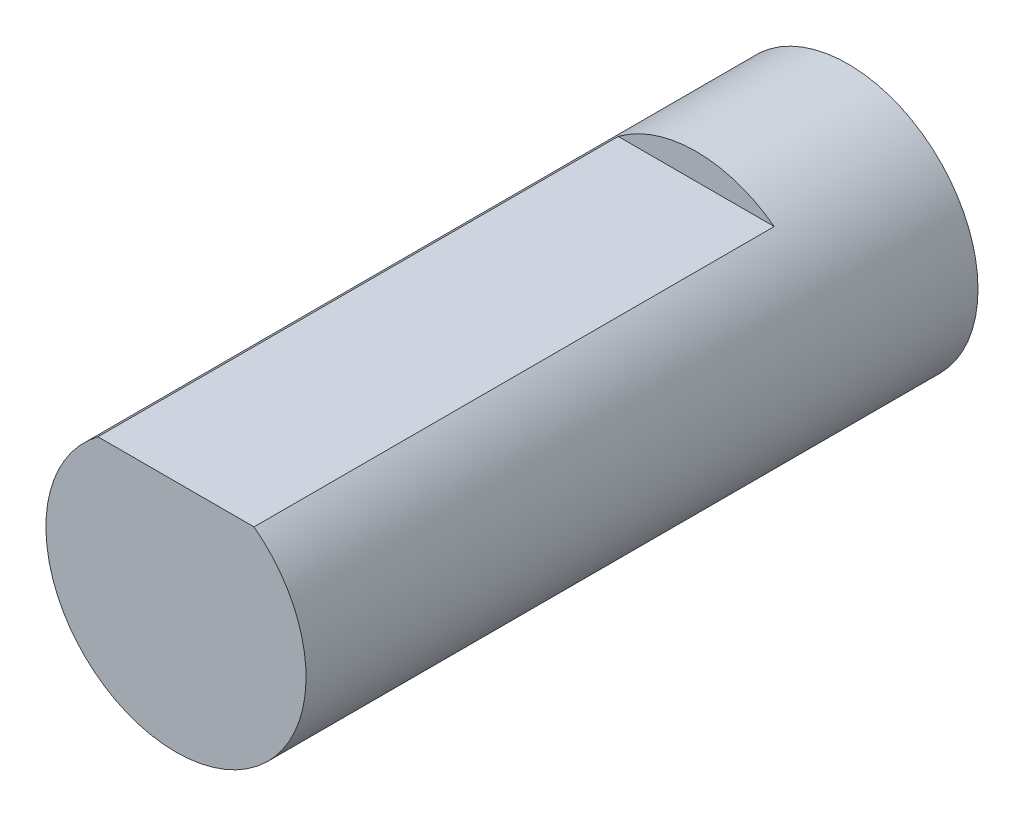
from build123d import *

# Parameters (mm, degrees)
ESQUISSE1_R             = 3
BOSS_EXTRU_1_DEPTH      = 15.5
ENL_V_START             = -12
ENL_V_MAT_EXTRU_1_DEPTH = 12


with BuildPart() as part:
    # Esquisse1 → Boss.-Extru.1 (new body)
    with BuildSketch(Plane.XY):
        Circle(ESQUISSE1_R)
    extrude(amount=BOSS_EXTRU_1_DEPTH)

    # Esquisse2 → Enl_v. mat.-Extru.1 (cut)
    with BuildSketch(Plane.XY.offset(15.5).offset(ENL_V_START)):
        with BuildLine():
            Line((-1.8, 2.4), (1.8, 2.4))
            ThreePointArc((1.8, 2.4), (0, 3), (-1.8, 2.4))
        make_face()
    extrude(amount=ENL_V_MAT_EXTRU_1_DEPTH, mode=Mode.SUBTRACT)


solid = part.part
